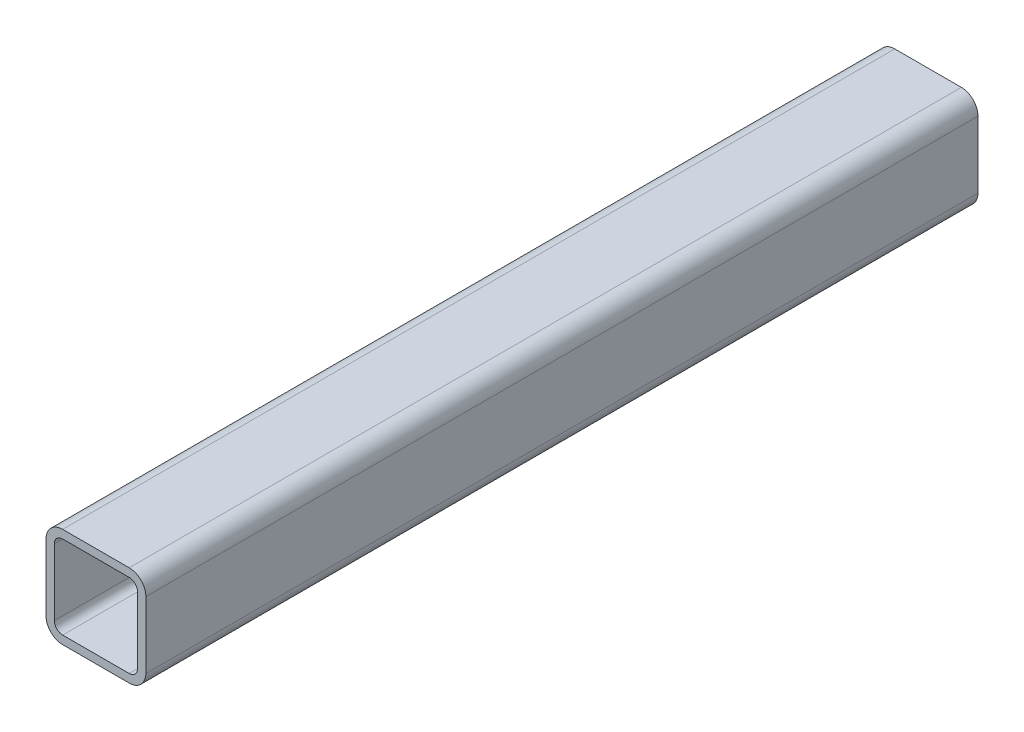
from build123d import *

# Parameters (mm, degrees)
BASE_EXTRUDE_THIN_DEPTH = 635


with BuildPart() as part:
    # Sketch1 → Base-Extrude-Thin (new body)
    with BuildSketch(Plane.XY):
        with BuildLine():
            Line((38.1, 25.4), (38.1, -25.4))
            ThreePointArc((38.1, -25.4), (34.380256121, -34.380256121), (25.4, -38.1))
            Line((25.4, -38.1), (-25.4, -38.1))
            ThreePointArc((-25.4, -38.1), (-34.380256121, -34.380256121), (-38.1, -25.4))
            Line((-38.1, -25.4), (-38.1, 25.4))
            ThreePointArc((-38.1, 25.4), (-34.380256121, 34.380256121), (-25.4, 38.1))
            Line((-25.4, 38.1), (25.4, 38.1))
            ThreePointArc((25.4, 38.1), (34.380256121, 34.380256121), (38.1, 25.4))
        make_face()
        with BuildLine():
            Line((31.75, 25.4), (31.75, -25.4))
            ThreePointArc((31.75, -25.4), (29.890128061, -29.890128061), (25.4, -31.75))
            Line((25.4, -31.75), (-25.4, -31.75))
            ThreePointArc((-25.4, -31.75), (-29.890128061, -29.890128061), (-31.75, -25.4))
            Line((-31.75, -25.4), (-31.75, 25.4))
            ThreePointArc((-31.75, 25.4), (-29.890128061, 29.890128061), (-25.4, 31.75))
            Line((-25.4, 31.75), (25.4, 31.75))
            ThreePointArc((25.4, 31.75), (29.890128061, 29.890128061), (31.75, 25.4))
        make_face(mode=Mode.SUBTRACT)
    extrude(amount=BASE_EXTRUDE_THIN_DEPTH)


solid = part.part
